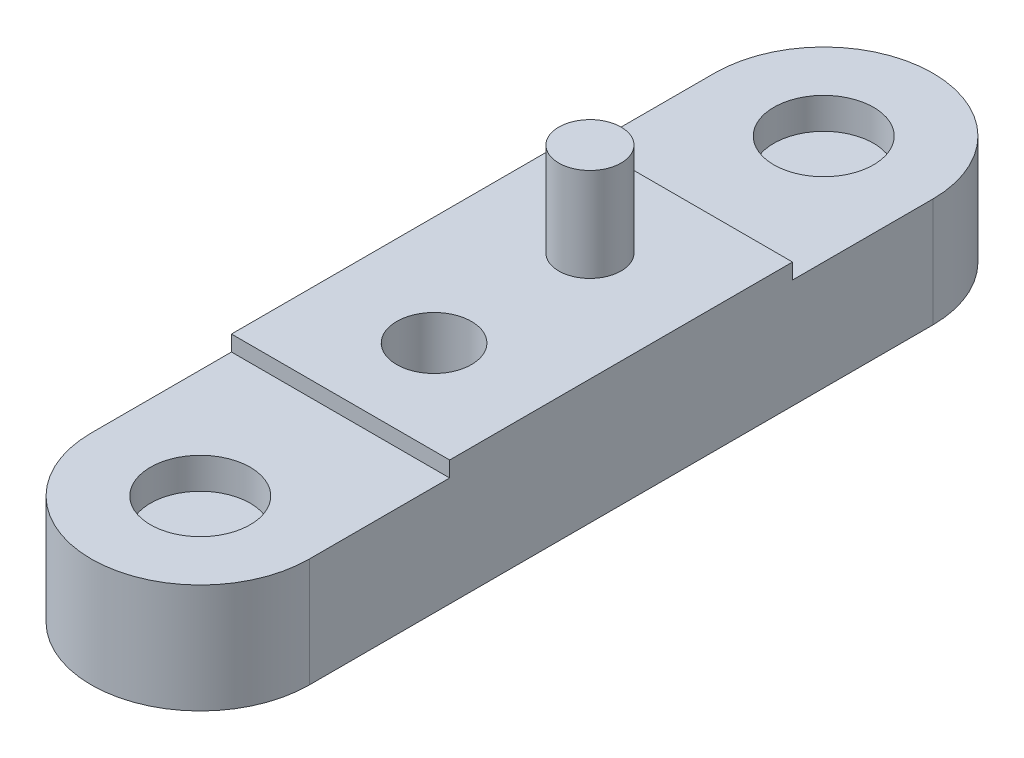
from build123d import *

# Parameters (mm, degrees)
BOSS_EXTRUDE1_DEPTH = 4
CUT_EXTRUDE1_START  = -0.5
CUT_EXTRUDE1_DEPTH  = 0.5
SKETCH3_R           = 1.6
CUT_EXTRUDE2_DEPTH  = 1
SKETCH4_R           = 1
BOSS_EXTRUDE2_DEPTH = 3
SKETCH5_R           = 1.2
CUT_EXTRUDE3_DEPTH  = 4


with BuildPart() as part:
    # Sketch1 → Boss-Extrude1 (new body)
    with BuildSketch(Plane(origin=(0, 0, 0), x_dir=(1, 0, 0), z_dir=(0, 1, 0))):
        with BuildLine():
            Line((-3.5, -10), (3.5, -10))
            Line((3.5, -10), (3.5, 0))
            ThreePointArc((3.5, 0), (0, 3.5), (-3.5, 0))
            Line((-3.5, 0), (-3.5, -10))
        make_face()
    extrude(amount=BOSS_EXTRUDE1_DEPTH)

    # Sketch2 → Cut-Extrude1 (cut)
    with BuildSketch(Plane(origin=(0, 4, 0), x_dir=(1, 0, 0), z_dir=(0, 1, 0)).offset(CUT_EXTRUDE1_START)):
        with BuildLine():
            Line((-3.5, -4.5), (3.5, -4.5))
            Line((3.5, -4.5), (3.5, 0))
            ThreePointArc((3.5, 0), (0, 3.5), (-3.5, 0))
            Line((-3.5, 0), (-3.5, -4.5))
        make_face()
    extrude(amount=CUT_EXTRUDE1_DEPTH, mode=Mode.SUBTRACT)

    # Sketch3 → Cut-Extrude2 (cut)
    with BuildSketch(Plane(origin=(0, 3.5, 0), x_dir=(1, 0, 0), z_dir=(0, 1, 0))):
        with Locations(Location((0, 0, 0), (0, 0, 270))):
            Circle(SKETCH3_R)
    extrude(amount=-CUT_EXTRUDE2_DEPTH, mode=Mode.SUBTRACT)

    # Mirror1: part across plane


with BuildPart() as part_1:
    add(part.part)
    add(part.part.mirror(Plane(origin=(-3.5, 4, 10), x_dir=(1, 0, 0), z_dir=(0, 0, -1))))

    # Sketch4 → Boss-Extrude2 (add)
    with BuildSketch(Plane(origin=(0, 4, 0), x_dir=(1, 0, 0), z_dir=(0, 1, 0))):
        with Locations(Location((0, -7.5, 0), (0, 0, 270))):
            Circle(SKETCH4_R)
    extrude(amount=BOSS_EXTRUDE2_DEPTH)

    # Sketch5 → Cut-Extrude3 (cut)
    with BuildSketch(Plane(origin=(0, 4, 0), x_dir=(1, 0, 0), z_dir=(0, 1, 0))):
        with Locations(Location((0, -12.5, 0), (0, 0, 270))):
            Circle(SKETCH5_R)
    extrude(amount=-CUT_EXTRUDE3_DEPTH, mode=Mode.SUBTRACT)


solid = part_1.part
